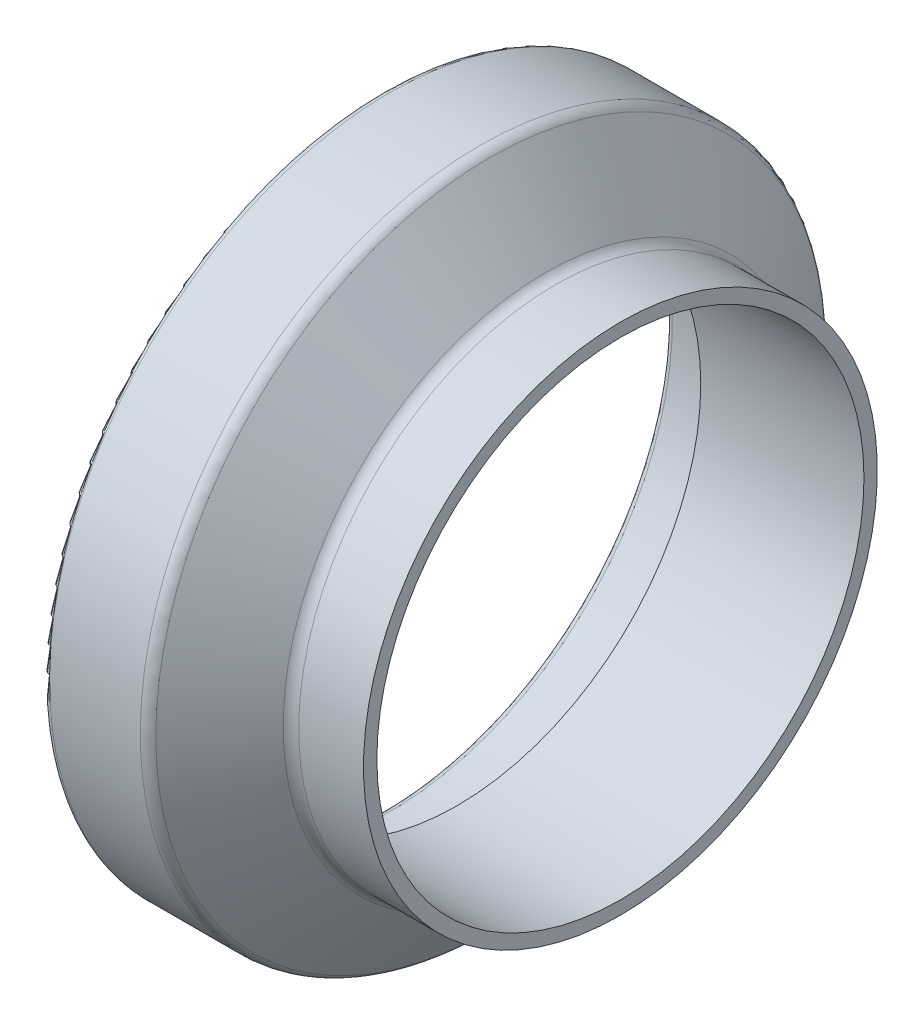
ISO-10303-21;
HEADER;
FILE_DESCRIPTION(('STEP AP214'),'2;1');
FILE_NAME('part.step','',(''),(''),'','','');
FILE_SCHEMA(('AUTOMOTIVE_DESIGN { 1 0 10303 214 1 1 1 1 }'));
ENDSEC;
DATA;
#1=APPLICATION_CONTEXT('core data for automotive mechanical design processes');
#2=APPLICATION_PROTOCOL_DEFINITION('international standard','automotive_design',2000,#1);
#3=PRODUCT_CONTEXT('',#1,'mechanical');
#4=PRODUCT('Part','Part','',(#3));
#5=PRODUCT_RELATED_PRODUCT_CATEGORY('part','',(#4));
#6=PRODUCT_DEFINITION_FORMATION('','',#4);
#7=PRODUCT_DEFINITION_CONTEXT('part definition',#1,'design');
#8=PRODUCT_DEFINITION('design','',#6,#7);
#9=PRODUCT_DEFINITION_SHAPE('','',#8);
#10=(LENGTH_UNIT() NAMED_UNIT(*) SI_UNIT(.MILLI.,.METRE.));
#11=(NAMED_UNIT(*) PLANE_ANGLE_UNIT() SI_UNIT($,.RADIAN.));
#12=(NAMED_UNIT(*) SI_UNIT($,.STERADIAN.) SOLID_ANGLE_UNIT());
#13=UNCERTAINTY_MEASURE_WITH_UNIT(LENGTH_MEASURE(1.E-05),#10,'distance_accuracy_value','');
#14=(GEOMETRIC_REPRESENTATION_CONTEXT(3) GLOBAL_UNCERTAINTY_ASSIGNED_CONTEXT((#13)) GLOBAL_UNIT_ASSIGNED_CONTEXT((#10,
#11,#12)) REPRESENTATION_CONTEXT('',''));
#15=CARTESIAN_POINT('',(0.,0.,0.));
#16=DIRECTION('',(0.,0.,1.));
#17=DIRECTION('',(1.,0.,0.));
#18=AXIS2_PLACEMENT_3D('',#15,#16,#17);
#19=CARTESIAN_POINT('',(-6.4271835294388,31.75,0.));
#20=DIRECTION('',(0.999999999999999,0.,0.));
#21=DIRECTION('',(0.,0.999999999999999,0.));
#22=AXIS2_PLACEMENT_3D('',#19,#20,#21);
#23=PLANE('',#22);
#24=CARTESIAN_POINT('',(-6.42718352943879,0.,0.));
#25=DIRECTION('',(0.999999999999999,0.,0.));
#26=DIRECTION('',(0.,0.999999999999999,0.));
#27=AXIS2_PLACEMENT_3D('',#24,#25,#26);
#28=CIRCLE('',#27,31.75);
#29=CARTESIAN_POINT('',(-6.4271835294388,31.75,0.));
#30=VERTEX_POINT('',#29);
#31=EDGE_CURVE('E81',#30,#30,#28,.T.);
#32=ORIENTED_EDGE('',*,*,#31,.T.);
#33=EDGE_LOOP('',(#32));
#34=FACE_BOUND('',#33,.T.);
#35=CARTESIAN_POINT('',(-6.42718352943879,0.,0.));
#36=DIRECTION('',(0.999999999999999,0.,0.));
#37=DIRECTION('',(0.,0.999999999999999,0.));
#38=AXIS2_PLACEMENT_3D('',#35,#36,#37);
#39=CIRCLE('',#38,30.099);
#40=CARTESIAN_POINT('',(-6.4271835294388,30.099,0.));
#41=VERTEX_POINT('',#40);
#42=EDGE_CURVE('E12',#41,#41,#39,.T.);
#43=ORIENTED_EDGE('',*,*,#42,.F.);
#44=EDGE_LOOP('',(#43));
#45=FACE_BOUND('',#44,.T.);
#46=ADVANCED_FACE('F38',(#34,#45),#23,.T.);
#47=CARTESIAN_POINT('',(0.,0.,0.));
#48=DIRECTION('',(0.999999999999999,0.,0.));
#49=DIRECTION('',(0.,0.999999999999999,0.));
#50=AXIS2_PLACEMENT_3D('',#47,#48,#49);
#51=CYLINDRICAL_SURFACE('',#50,30.099);
#52=CARTESIAN_POINT('',(-26.5947835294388,0.,0.));
#53=DIRECTION('',(0.999999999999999,0.,0.));
#54=DIRECTION('',(0.,0.999999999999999,0.));
#55=AXIS2_PLACEMENT_3D('',#52,#53,#54);
#56=CIRCLE('',#55,30.099);
#57=CARTESIAN_POINT('',(-26.5947835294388,30.099,0.));
#58=VERTEX_POINT('',#57);
#59=EDGE_CURVE('E44',#58,#58,#56,.T.);
#60=CARTESIAN_POINT('',(-6.4271835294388,30.099,0.));
#61=CARTESIAN_POINT('',(-6.63726269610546,30.099,0.));
#62=CARTESIAN_POINT('',(-6.84734186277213,30.099,0.));
#63=CARTESIAN_POINT('',(-7.26750019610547,30.099,0.));
#64=CARTESIAN_POINT('',(-7.47757936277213,30.099,0.));
#65=CARTESIAN_POINT('',(-7.89773769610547,30.099,0.));
#66=CARTESIAN_POINT('',(-8.10781686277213,30.099,0.));
#67=CARTESIAN_POINT('',(-8.52797519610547,30.099,0.));
#68=CARTESIAN_POINT('',(-8.73805436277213,30.099,0.));
#69=CARTESIAN_POINT('',(-9.15821269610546,30.099,0.));
#70=CARTESIAN_POINT('',(-9.36829186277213,30.099,0.));
#71=CARTESIAN_POINT('',(-9.78845019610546,30.099,0.));
#72=CARTESIAN_POINT('',(-9.99852936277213,30.099,0.));
#73=CARTESIAN_POINT('',(-10.4186876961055,30.099,0.));
#74=CARTESIAN_POINT('',(-10.6287668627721,30.099,0.));
#75=CARTESIAN_POINT('',(-11.0489251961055,30.099,0.));
#76=CARTESIAN_POINT('',(-11.2590043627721,30.099,0.));
#77=CARTESIAN_POINT('',(-11.6791626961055,30.099,0.));
#78=CARTESIAN_POINT('',(-11.8892418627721,30.099,0.));
#79=CARTESIAN_POINT('',(-12.3094001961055,30.099,0.));
#80=CARTESIAN_POINT('',(-12.5194793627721,30.099,0.));
#81=CARTESIAN_POINT('',(-12.9396376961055,30.099,0.));
#82=CARTESIAN_POINT('',(-13.1497168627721,30.099,0.));
#83=CARTESIAN_POINT('',(-13.5698751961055,30.099,0.));
#84=CARTESIAN_POINT('',(-13.7799543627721,30.099,0.));
#85=CARTESIAN_POINT('',(-14.2001126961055,30.099,0.));
#86=CARTESIAN_POINT('',(-14.4101918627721,30.099,0.));
#87=CARTESIAN_POINT('',(-14.8303501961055,30.099,0.));
#88=CARTESIAN_POINT('',(-15.0404293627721,30.099,0.));
#89=CARTESIAN_POINT('',(-15.4605876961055,30.099,0.));
#90=CARTESIAN_POINT('',(-15.6706668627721,30.099,0.));
#91=CARTESIAN_POINT('',(-16.0908251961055,30.099,0.));
#92=CARTESIAN_POINT('',(-16.3009043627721,30.099,0.));
#93=CARTESIAN_POINT('',(-16.7210626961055,30.099,0.));
#94=CARTESIAN_POINT('',(-16.9311418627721,30.099,0.));
#95=CARTESIAN_POINT('',(-17.3513001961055,30.099,0.));
#96=CARTESIAN_POINT('',(-17.5613793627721,30.099,0.));
#97=CARTESIAN_POINT('',(-17.9815376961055,30.099,0.));
#98=CARTESIAN_POINT('',(-18.1916168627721,30.099,0.));
#99=CARTESIAN_POINT('',(-18.6117751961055,30.099,0.));
#100=CARTESIAN_POINT('',(-18.8218543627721,30.099,0.));
#101=CARTESIAN_POINT('',(-19.2420126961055,30.099,0.));
#102=CARTESIAN_POINT('',(-19.4520918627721,30.099,0.));
#103=CARTESIAN_POINT('',(-19.8722501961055,30.099,0.));
#104=CARTESIAN_POINT('',(-20.0823293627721,30.099,0.));
#105=CARTESIAN_POINT('',(-20.5024876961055,30.099,0.));
#106=CARTESIAN_POINT('',(-20.7125668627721,30.099,0.));
#107=CARTESIAN_POINT('',(-21.1327251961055,30.099,0.));
#108=CARTESIAN_POINT('',(-21.3428043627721,30.099,0.));
#109=CARTESIAN_POINT('',(-21.7629626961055,30.099,0.));
#110=CARTESIAN_POINT('',(-21.9730418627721,30.099,0.));
#111=CARTESIAN_POINT('',(-22.3932001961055,30.099,0.));
#112=CARTESIAN_POINT('',(-22.6032793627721,30.099,0.));
#113=CARTESIAN_POINT('',(-23.0234376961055,30.099,0.));
#114=CARTESIAN_POINT('',(-23.2335168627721,30.099,0.));
#115=CARTESIAN_POINT('',(-23.6536751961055,30.099,0.));
#116=CARTESIAN_POINT('',(-23.8637543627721,30.099,0.));
#117=CARTESIAN_POINT('',(-24.2839126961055,30.099,0.));
#118=CARTESIAN_POINT('',(-24.4939918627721,30.099,0.));
#119=CARTESIAN_POINT('',(-24.9141501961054,30.099,0.));
#120=CARTESIAN_POINT('',(-25.1242293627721,30.099,0.));
#121=CARTESIAN_POINT('',(-25.5443876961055,30.099,0.));
#122=CARTESIAN_POINT('',(-25.7544668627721,30.099,0.));
#123=CARTESIAN_POINT('',(-26.1746251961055,30.099,0.));
#124=CARTESIAN_POINT('',(-26.3847043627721,30.099,0.));
#125=CARTESIAN_POINT('',(-26.5947835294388,30.099,0.));
#126=B_SPLINE_CURVE_WITH_KNOTS('',3,(#60,#61,#62,#63,#64,#65,#66,#67,#68,#69,#70,#71,#72,#73,
#74,#75,#76,#77,#78,#79,#80,#81,#82,#83,#84,#85,#86,#87,#88,#89,#90,#91,#92,#93,#94,#95,#96,#97,
#98,#99,#100,#101,#102,#103,#104,#105,#106,#107,#108,#109,#110,#111,#112,#113,#114,#115,#116,
#117,#118,#119,#120,#121,#122,#123,#124,#125),.UNSPECIFIED.,.F.,.F.,(4,2,2,2,2,2,2,2,2,2,2,2,2,
2,2,2,2,2,2,2,2,2,2,2,2,2,2,2,2,2,2,2,4),(0.,0.6302375,1.260475,1.8907125,2.52095,3.1511875,
3.781425,4.4116625,5.0419,5.6721375,6.302375,6.9326125,7.56285,8.19308749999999,8.823325,
9.45356249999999,10.0838,10.7140375,11.344275,11.9745125,12.60475,13.2349875,13.865225,
14.4954625,15.1257,15.7559375,16.386175,17.0164125,17.64665,18.2768875,18.907125,19.5373625,
20.1676),.UNSPECIFIED.);
#127=EDGE_CURVE('BSEAM99',#41,#58,#126,.T.);
#128=ORIENTED_EDGE('',*,*,#42,.T.);
#129=ORIENTED_EDGE('',*,*,#59,.F.);
#130=ORIENTED_EDGE('',*,*,#127,.T.);
#131=ORIENTED_EDGE('',*,*,#127,.F.);
#132=EDGE_LOOP('',(#128,#130,#129,#131));
#133=FACE_BOUND('',#132,.T.);
#134=ADVANCED_FACE('F99',(#133),#51,.F.);
#135=CARTESIAN_POINT('',(-26.5947835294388,30.099,0.));
#136=DIRECTION('',(-0.999999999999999,0.,0.));
#137=DIRECTION('',(0.,-0.999999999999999,0.));
#138=AXIS2_PLACEMENT_3D('',#135,#136,#137);
#139=PLANE('',#138);
#140=ORIENTED_EDGE('',*,*,#59,.T.);
#141=EDGE_LOOP('',(#140));
#142=FACE_BOUND('',#141,.T.);
#143=CARTESIAN_POINT('',(-26.5947835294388,0.,0.));
#144=DIRECTION('',(0.999999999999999,0.,0.));
#145=DIRECTION('',(0.,0.999999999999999,0.));
#146=AXIS2_PLACEMENT_3D('',#143,#144,#145);
#147=CIRCLE('',#146,34.1503);
#148=CARTESIAN_POINT('',(-26.5947835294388,34.1503,0.));
#149=VERTEX_POINT('',#148);
#150=EDGE_CURVE('E48',#149,#149,#147,.T.);
#151=ORIENTED_EDGE('',*,*,#150,.F.);
#152=EDGE_LOOP('',(#151));
#153=FACE_BOUND('',#152,.T.);
#154=ADVANCED_FACE('F103',(#142,#153),#139,.T.);
#155=CARTESIAN_POINT('',(-27.4075835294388,0.,0.));
#156=DIRECTION('',(0.999999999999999,0.,0.));
#157=DIRECTION('',(0.,0.999999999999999,0.));
#158=AXIS2_PLACEMENT_3D('',#155,#156,#157);
#159=TOROIDAL_SURFACE('',#158,34.1503,0.812799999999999);
#160=ORIENTED_EDGE('',*,*,#150,.T.);
#161=EDGE_LOOP('',(#160));
#162=FACE_BOUND('',#161,.T.);
#163=CARTESIAN_POINT('',(-27.4075835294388,0.,0.));
#164=DIRECTION('',(0.999999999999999,0.,0.));
#165=DIRECTION('',(0.,0.999999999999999,0.));
#166=AXIS2_PLACEMENT_3D('',#163,#164,#165);
#167=CIRCLE('',#166,34.9631);
#168=CARTESIAN_POINT('',(-27.4075835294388,34.9631,0.));
#169=VERTEX_POINT('',#168);
#170=EDGE_CURVE('E52',#169,#169,#167,.T.);
#171=ORIENTED_EDGE('',*,*,#170,.F.);
#172=EDGE_LOOP('',(#171));
#173=FACE_BOUND('',#172,.T.);
#174=ADVANCED_FACE('F107',(#162,#173),#159,.F.);
#175=CARTESIAN_POINT('',(0.,0.,0.));
#176=DIRECTION('',(0.999999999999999,0.,0.));
#177=DIRECTION('',(0.,0.999999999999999,0.));
#178=AXIS2_PLACEMENT_3D('',#175,#176,#177);
#179=CYLINDRICAL_SURFACE('',#178,34.9631);
#180=CARTESIAN_POINT('',(-34.9767835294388,0.,0.));
#181=DIRECTION('',(0.999999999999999,0.,0.));
#182=DIRECTION('',(0.,0.999999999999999,0.));
#183=AXIS2_PLACEMENT_3D('',#180,#181,#182);
#184=CIRCLE('',#183,34.9631);
#185=CARTESIAN_POINT('',(-34.9767835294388,34.9631,0.));
#186=VERTEX_POINT('',#185);
#187=EDGE_CURVE('E57',#186,#186,#184,.T.);
#188=CARTESIAN_POINT('',(-27.4075835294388,34.9631,0.));
#189=CARTESIAN_POINT('',(-27.4864293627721,34.9631,0.));
#190=CARTESIAN_POINT('',(-27.5652751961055,34.9631,0.));
#191=CARTESIAN_POINT('',(-27.7229668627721,34.9631,0.));
#192=CARTESIAN_POINT('',(-27.8018126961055,34.9631,0.));
#193=CARTESIAN_POINT('',(-27.9595043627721,34.9631,0.));
#194=CARTESIAN_POINT('',(-28.0383501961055,34.9631,0.));
#195=CARTESIAN_POINT('',(-28.1960418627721,34.9631,0.));
#196=CARTESIAN_POINT('',(-28.2748876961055,34.9631,0.));
#197=CARTESIAN_POINT('',(-28.4325793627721,34.9631,0.));
#198=CARTESIAN_POINT('',(-28.5114251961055,34.9631,0.));
#199=CARTESIAN_POINT('',(-28.6691168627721,34.9631,0.));
#200=CARTESIAN_POINT('',(-28.7479626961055,34.9631,0.));
#201=CARTESIAN_POINT('',(-28.9056543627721,34.9631,0.));
#202=CARTESIAN_POINT('',(-28.9845001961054,34.9631,0.));
#203=CARTESIAN_POINT('',(-29.1421918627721,34.9631,0.));
#204=CARTESIAN_POINT('',(-29.2210376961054,34.9631,0.));
#205=CARTESIAN_POINT('',(-29.3787293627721,34.9631,0.));
#206=CARTESIAN_POINT('',(-29.4575751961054,34.9631,0.));
#207=CARTESIAN_POINT('',(-29.6152668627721,34.9631,0.));
#208=CARTESIAN_POINT('',(-29.6941126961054,34.9631,0.));
#209=CARTESIAN_POINT('',(-29.8518043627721,34.9631,0.));
#210=CARTESIAN_POINT('',(-29.9306501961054,34.9631,0.));
#211=CARTESIAN_POINT('',(-30.0883418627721,34.9631,0.));
#212=CARTESIAN_POINT('',(-30.1671876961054,34.9631,0.));
#213=CARTESIAN_POINT('',(-30.3248793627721,34.9631,0.));
#214=CARTESIAN_POINT('',(-30.4037251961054,34.9631,0.));
#215=CARTESIAN_POINT('',(-30.5614168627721,34.9631,0.));
#216=CARTESIAN_POINT('',(-30.6402626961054,34.9631,0.));
#217=CARTESIAN_POINT('',(-30.7979543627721,34.9631,0.));
#218=CARTESIAN_POINT('',(-30.8768001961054,34.9631,0.));
#219=CARTESIAN_POINT('',(-31.0344918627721,34.9631,0.));
#220=CARTESIAN_POINT('',(-31.1133376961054,34.9631,0.));
#221=CARTESIAN_POINT('',(-31.2710293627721,34.9631,0.));
#222=CARTESIAN_POINT('',(-31.3498751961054,34.9631,0.));
#223=CARTESIAN_POINT('',(-31.5075668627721,34.9631,0.));
#224=CARTESIAN_POINT('',(-31.5864126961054,34.9631,0.));
#225=CARTESIAN_POINT('',(-31.7441043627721,34.9631,0.));
#226=CARTESIAN_POINT('',(-31.8229501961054,34.9631,0.));
#227=CARTESIAN_POINT('',(-31.9806418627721,34.9631,0.));
#228=CARTESIAN_POINT('',(-32.0594876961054,34.9631,0.));
#229=CARTESIAN_POINT('',(-32.2171793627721,34.9631,0.));
#230=CARTESIAN_POINT('',(-32.2960251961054,34.9631,0.));
#231=CARTESIAN_POINT('',(-32.4537168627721,34.9631,0.));
#232=CARTESIAN_POINT('',(-32.5325626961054,34.9631,0.));
#233=CARTESIAN_POINT('',(-32.6902543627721,34.9631,0.));
#234=CARTESIAN_POINT('',(-32.7691001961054,34.9631,0.));
#235=CARTESIAN_POINT('',(-32.9267918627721,34.9631,0.));
#236=CARTESIAN_POINT('',(-33.0056376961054,34.9631,0.));
#237=CARTESIAN_POINT('',(-33.1633293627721,34.9631,0.));
#238=CARTESIAN_POINT('',(-33.2421751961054,34.9631,0.));
#239=CARTESIAN_POINT('',(-33.3998668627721,34.9631,0.));
#240=CARTESIAN_POINT('',(-33.4787126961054,34.9631,0.));
#241=CARTESIAN_POINT('',(-33.6364043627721,34.9631,0.));
#242=CARTESIAN_POINT('',(-33.7152501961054,34.9631,0.));
#243=CARTESIAN_POINT('',(-33.8729418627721,34.9631,0.));
#244=CARTESIAN_POINT('',(-33.9517876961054,34.9631,0.));
#245=CARTESIAN_POINT('',(-34.1094793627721,34.9631,0.));
#246=CARTESIAN_POINT('',(-34.1883251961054,34.9631,0.));
#247=CARTESIAN_POINT('',(-34.3460168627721,34.9631,0.));
#248=CARTESIAN_POINT('',(-34.4248626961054,34.9631,0.));
#249=CARTESIAN_POINT('',(-34.5825543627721,34.9631,0.));
#250=CARTESIAN_POINT('',(-34.6614001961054,34.9631,0.));
#251=CARTESIAN_POINT('',(-34.8190918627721,34.9631,0.));
#252=CARTESIAN_POINT('',(-34.8979376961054,34.9631,0.));
#253=CARTESIAN_POINT('',(-34.9767835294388,34.9631,0.));
#254=B_SPLINE_CURVE_WITH_KNOTS('',3,(#188,#189,#190,#191,#192,#193,#194,#195,#196,#197,#198,
#199,#200,#201,#202,#203,#204,#205,#206,#207,#208,#209,#210,#211,#212,#213,#214,#215,#216,#217,
#218,#219,#220,#221,#222,#223,#224,#225,#226,#227,#228,#229,#230,#231,#232,#233,#234,#235,#236,
#237,#238,#239,#240,#241,#242,#243,#244,#245,#246,#247,#248,#249,#250,#251,#252,#253),
.UNSPECIFIED.,.F.,.F.,(4,2,2,2,2,2,2,2,2,2,2,2,2,2,2,2,2,2,2,2,2,2,2,2,2,2,2,2,2,2,2,2,4),(0.,
0.236537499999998,0.473075,0.709612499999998,0.946149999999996,1.1826875,1.41922499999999,
1.65576249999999,1.89229999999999,2.12883749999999,2.36537499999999,2.60191249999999,
2.83844999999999,3.07498749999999,3.31152499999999,3.54806249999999,3.78459999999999,
4.02113749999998,4.25767499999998,4.49421249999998,4.73074999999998,4.96728749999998,
5.20382499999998,5.44036249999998,5.67689999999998,5.91343749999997,6.14997499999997,
6.38651249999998,6.62304999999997,6.85958749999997,7.09612499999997,7.33266249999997,
7.56919999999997),.UNSPECIFIED.);
#255=EDGE_CURVE('BSEAM113',#169,#186,#254,.T.);
#256=ORIENTED_EDGE('',*,*,#170,.T.);
#257=ORIENTED_EDGE('',*,*,#187,.F.);
#258=ORIENTED_EDGE('',*,*,#255,.T.);
#259=ORIENTED_EDGE('',*,*,#255,.F.);
#260=EDGE_LOOP('',(#256,#258,#257,#259));
#261=FACE_BOUND('',#260,.T.);
#262=ADVANCED_FACE('F113',(#261),#179,.F.);
#263=CARTESIAN_POINT('',(-34.9767835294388,0.,0.));
#264=DIRECTION('',(0.999999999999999,0.,0.));
#265=DIRECTION('',(0.,0.999999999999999,0.));
#266=AXIS2_PLACEMENT_3D('',#263,#264,#265);
#267=TOROIDAL_SURFACE('',#266,35.7759,0.812800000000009);
#268=ORIENTED_EDGE('',*,*,#187,.T.);
#269=EDGE_LOOP('',(#268));
#270=FACE_BOUND('',#269,.T.);
#271=CARTESIAN_POINT('',(-35.7895835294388,0.,0.));
#272=DIRECTION('',(0.999999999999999,0.,0.));
#273=DIRECTION('',(0.,0.999999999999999,0.));
#274=AXIS2_PLACEMENT_3D('',#271,#272,#273);
#275=CIRCLE('',#274,35.7759);
#276=CARTESIAN_POINT('',(-35.7895835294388,35.7759,0.));
#277=VERTEX_POINT('',#276);
#278=EDGE_CURVE('E60',#277,#277,#275,.T.);
#279=ORIENTED_EDGE('',*,*,#278,.F.);
#280=EDGE_LOOP('',(#279));
#281=FACE_BOUND('',#280,.T.);
#282=ADVANCED_FACE('F117',(#270,#281),#267,.T.);
#283=CARTESIAN_POINT('',(-35.7895835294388,35.7759,0.));
#284=DIRECTION('',(-0.999999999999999,0.,0.));
#285=DIRECTION('',(0.,-0.999999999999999,0.));
#286=AXIS2_PLACEMENT_3D('',#283,#284,#285);
#287=PLANE('',#286);
#288=ORIENTED_EDGE('',*,*,#278,.T.);
#289=EDGE_LOOP('',(#288));
#290=FACE_BOUND('',#289,.T.);
#291=CARTESIAN_POINT('',(-35.7895835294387,0.,0.));
#292=DIRECTION('',(0.999999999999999,0.,0.));
#293=DIRECTION('',(0.,0.999999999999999,0.));
#294=AXIS2_PLACEMENT_3D('',#291,#292,#293);
#295=CIRCLE('',#294,41.1861);
#296=CARTESIAN_POINT('',(-35.7895835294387,41.1860999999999,0.));
#297=VERTEX_POINT('',#296);
#298=EDGE_CURVE('E63',#297,#297,#295,.T.);
#299=ORIENTED_EDGE('',*,*,#298,.F.);
#300=EDGE_LOOP('',(#299));
#301=FACE_BOUND('',#300,.T.);
#302=ADVANCED_FACE('F121',(#290,#301),#287,.T.);
#303=CARTESIAN_POINT('',(-34.9767835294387,0.,0.));
#304=DIRECTION('',(0.999999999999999,0.,0.));
#305=DIRECTION('',(0.,0.999999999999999,0.));
#306=AXIS2_PLACEMENT_3D('',#303,#304,#305);
#307=TOROIDAL_SURFACE('',#306,41.1861,0.812799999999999);
#308=ORIENTED_EDGE('',*,*,#298,.T.);
#309=EDGE_LOOP('',(#308));
#310=FACE_BOUND('',#309,.T.);
#311=CARTESIAN_POINT('',(-34.9767835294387,0.,0.));
#312=DIRECTION('',(0.999999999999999,0.,0.));
#313=DIRECTION('',(0.,0.999999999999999,0.));
#314=AXIS2_PLACEMENT_3D('',#311,#312,#313);
#315=CIRCLE('',#314,41.9989);
#316=CARTESIAN_POINT('',(-34.9767835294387,41.9988999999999,0.));
#317=VERTEX_POINT('',#316);
#318=EDGE_CURVE('E66',#317,#317,#315,.T.);
#319=ORIENTED_EDGE('',*,*,#318,.F.);
#320=EDGE_LOOP('',(#319));
#321=FACE_BOUND('',#320,.T.);
#322=ADVANCED_FACE('F125',(#310,#321),#307,.T.);
#323=CARTESIAN_POINT('',(0.,0.,0.));
#324=DIRECTION('',(0.999999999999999,0.,0.));
#325=DIRECTION('',(0.,0.999999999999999,0.));
#326=AXIS2_PLACEMENT_3D('',#323,#324,#325);
#327=CYLINDRICAL_SURFACE('',#326,41.9989);
#328=CARTESIAN_POINT('',(-23.7604138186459,0.,0.));
#329=DIRECTION('',(0.999999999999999,0.,0.));
#330=DIRECTION('',(0.,0.999999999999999,0.));
#331=AXIS2_PLACEMENT_3D('',#328,#329,#330);
#332=CIRCLE('',#331,41.9989);
#333=CARTESIAN_POINT('',(-23.7604138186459,41.9988999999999,0.));
#334=VERTEX_POINT('',#333);
#335=EDGE_CURVE('E69',#334,#334,#332,.T.);
#336=CARTESIAN_POINT('',(-34.9767835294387,41.9988999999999,0.));
#337=CARTESIAN_POINT('',(-34.8599463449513,41.9988999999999,0.));
#338=CARTESIAN_POINT('',(-34.7431091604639,41.9988999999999,0.));
#339=CARTESIAN_POINT('',(-34.509434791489,41.9988999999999,0.));
#340=CARTESIAN_POINT('',(-34.3925976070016,41.9988999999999,0.));
#341=CARTESIAN_POINT('',(-34.1589232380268,41.9988999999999,0.));
#342=CARTESIAN_POINT('',(-34.0420860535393,41.9988999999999,0.));
#343=CARTESIAN_POINT('',(-33.8084116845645,41.9988999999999,0.));
#344=CARTESIAN_POINT('',(-33.6915745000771,41.9988999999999,0.));
#345=CARTESIAN_POINT('',(-33.4579001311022,41.9988999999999,0.));
#346=CARTESIAN_POINT('',(-33.3410629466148,41.9988999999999,0.));
#347=CARTESIAN_POINT('',(-33.1073885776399,41.9988999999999,0.));
#348=CARTESIAN_POINT('',(-32.9905513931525,41.9988999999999,0.));
#349=CARTESIAN_POINT('',(-32.7568770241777,41.9988999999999,0.));
#350=CARTESIAN_POINT('',(-32.6400398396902,41.9988999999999,0.));
#351=CARTESIAN_POINT('',(-32.4063654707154,41.9988999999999,0.));
#352=CARTESIAN_POINT('',(-32.289528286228,41.9988999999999,0.));
#353=CARTESIAN_POINT('',(-32.0558539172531,41.9988999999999,0.));
#354=CARTESIAN_POINT('',(-31.9390167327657,41.9988999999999,0.));
#355=CARTESIAN_POINT('',(-31.7053423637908,41.9988999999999,0.));
#356=CARTESIAN_POINT('',(-31.5885051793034,41.9988999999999,0.));
#357=CARTESIAN_POINT('',(-31.3548308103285,41.9988999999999,0.));
#358=CARTESIAN_POINT('',(-31.2379936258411,41.9988999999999,0.));
#359=CARTESIAN_POINT('',(-31.0043192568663,41.9988999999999,0.));
#360=CARTESIAN_POINT('',(-30.8874820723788,41.9988999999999,0.));
#361=CARTESIAN_POINT('',(-30.653807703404,41.9988999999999,0.));
#362=CARTESIAN_POINT('',(-30.5369705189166,41.9988999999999,0.));
#363=CARTESIAN_POINT('',(-30.3032961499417,41.9988999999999,0.));
#364=CARTESIAN_POINT('',(-30.1864589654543,41.9988999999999,0.));
#365=CARTESIAN_POINT('',(-29.9527845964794,41.9988999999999,0.));
#366=CARTESIAN_POINT('',(-29.835947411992,41.9988999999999,0.));
#367=CARTESIAN_POINT('',(-29.6022730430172,41.9988999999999,0.));
#368=CARTESIAN_POINT('',(-29.4854358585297,41.9988999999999,0.));
#369=CARTESIAN_POINT('',(-29.2517614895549,41.9988999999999,0.));
#370=CARTESIAN_POINT('',(-29.1349243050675,41.9988999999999,0.));
#371=CARTESIAN_POINT('',(-28.9012499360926,41.9988999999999,0.));
#372=CARTESIAN_POINT('',(-28.7844127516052,41.9988999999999,0.));
#373=CARTESIAN_POINT('',(-28.5507383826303,41.9988999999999,0.));
#374=CARTESIAN_POINT('',(-28.4339011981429,41.9988999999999,0.));
#375=CARTESIAN_POINT('',(-28.2002268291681,41.9988999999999,0.));
#376=CARTESIAN_POINT('',(-28.0833896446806,41.9988999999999,0.));
#377=CARTESIAN_POINT('',(-27.8497152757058,41.9988999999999,0.));
#378=CARTESIAN_POINT('',(-27.7328780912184,41.9988999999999,0.));
#379=CARTESIAN_POINT('',(-27.4992037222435,41.9988999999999,0.));
#380=CARTESIAN_POINT('',(-27.3823665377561,41.9988999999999,0.));
#381=CARTESIAN_POINT('',(-27.1486921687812,41.9988999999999,0.));
#382=CARTESIAN_POINT('',(-27.0318549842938,41.9988999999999,0.));
#383=CARTESIAN_POINT('',(-26.798180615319,41.9988999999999,0.));
#384=CARTESIAN_POINT('',(-26.6813434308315,41.9988999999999,0.));
#385=CARTESIAN_POINT('',(-26.4476690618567,41.9988999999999,0.));
#386=CARTESIAN_POINT('',(-26.3308318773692,41.9988999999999,0.));
#387=CARTESIAN_POINT('',(-26.0971575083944,41.9988999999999,0.));
#388=CARTESIAN_POINT('',(-25.980320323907,41.9988999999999,0.));
#389=CARTESIAN_POINT('',(-25.7466459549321,41.9988999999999,0.));
#390=CARTESIAN_POINT('',(-25.6298087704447,41.9988999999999,0.));
#391=CARTESIAN_POINT('',(-25.3961344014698,41.9988999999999,0.));
#392=CARTESIAN_POINT('',(-25.2792972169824,41.9988999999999,0.));
#393=CARTESIAN_POINT('',(-25.0456228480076,41.9988999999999,0.));
#394=CARTESIAN_POINT('',(-24.9287856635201,41.9988999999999,0.));
#395=CARTESIAN_POINT('',(-24.6951112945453,41.9988999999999,0.));
#396=CARTESIAN_POINT('',(-24.5782741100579,41.9988999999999,0.));
#397=CARTESIAN_POINT('',(-24.344599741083,41.9988999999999,0.));
#398=CARTESIAN_POINT('',(-24.2277625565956,41.9988999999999,0.));
#399=CARTESIAN_POINT('',(-23.9940881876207,41.9988999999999,0.));
#400=CARTESIAN_POINT('',(-23.8772510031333,41.9988999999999,0.));
#401=CARTESIAN_POINT('',(-23.7604138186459,41.9988999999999,0.));
#402=B_SPLINE_CURVE_WITH_KNOTS('',3,(#336,#337,#338,#339,#340,#341,#342,#343,#344,#345,#346,
#347,#348,#349,#350,#351,#352,#353,#354,#355,#356,#357,#358,#359,#360,#361,#362,#363,#364,#365,
#366,#367,#368,#369,#370,#371,#372,#373,#374,#375,#376,#377,#378,#379,#380,#381,#382,#383,#384,
#385,#386,#387,#388,#389,#390,#391,#392,#393,#394,#395,#396,#397,#398,#399,#400,#401),
.UNSPECIFIED.,.F.,.F.,(4,2,2,2,2,2,2,2,2,2,2,2,2,2,2,2,2,2,2,2,2,2,2,2,2,2,2,2,2,2,2,2,4),(0.,
0.350511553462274,0.701023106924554,1.05153466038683,1.40204621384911,1.75255776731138,
2.10306932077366,2.45358087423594,2.80409242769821,3.15460398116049,3.50511553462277,
3.85562708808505,4.20613864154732,4.5566501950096,4.90716174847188,5.25767330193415,
5.60818485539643,5.95869640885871,6.30920796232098,6.65971951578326,7.01023106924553,
7.36074262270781,7.71125417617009,8.06176572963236,8.41227728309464,8.76278883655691,
9.11330039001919,9.46381194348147,9.81432349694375,10.164835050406,10.5153466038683,
10.8658581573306,11.2163697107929),.UNSPECIFIED.);
#403=EDGE_CURVE('BSEAM129',#317,#334,#402,.T.);
#404=ORIENTED_EDGE('',*,*,#318,.T.);
#405=ORIENTED_EDGE('',*,*,#335,.F.);
#406=ORIENTED_EDGE('',*,*,#403,.T.);
#407=ORIENTED_EDGE('',*,*,#403,.F.);
#408=EDGE_LOOP('',(#404,#406,#405,#407));
#409=FACE_BOUND('',#408,.T.);
#410=ADVANCED_FACE('F129',(#409),#327,.T.);
#411=CARTESIAN_POINT('',(-23.7604138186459,0.,0.));
#412=DIRECTION('',(0.999999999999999,0.,0.));
#413=DIRECTION('',(0.,0.999999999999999,0.));
#414=AXIS2_PLACEMENT_3D('',#411,#412,#413);
#415=TOROIDAL_SURFACE('',#414,40.3987,1.60019999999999);
#416=ORIENTED_EDGE('',*,*,#335,.T.);
#417=EDGE_LOOP('',(#416));
#418=FACE_BOUND('',#417,.T.);
#419=CARTESIAN_POINT('',(-22.4824372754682,0.,0.));
#420=DIRECTION('',(0.999999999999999,0.,0.));
#421=DIRECTION('',(0.,0.999999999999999,0.));
#422=AXIS2_PLACEMENT_3D('',#419,#420,#421);
#423=CIRCLE('',#422,41.3617244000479);
#424=CARTESIAN_POINT('',(-22.4824372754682,-41.3617244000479,0.));
#425=VERTEX_POINT('',#424);
#426=EDGE_CURVE('E72',#425,#425,#423,.T.);
#427=ORIENTED_EDGE('',*,*,#426,.F.);
#428=EDGE_LOOP('',(#427));
#429=FACE_BOUND('',#428,.T.);
#430=ADVANCED_FACE('F133',(#418,#429),#415,.T.);
#431=CARTESIAN_POINT('',(-15.7196296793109,0.,0.));
#432=DIRECTION('',(-0.999999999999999,0.,0.));
#433=DIRECTION('',(0.,-0.999999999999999,0.));
#434=AXIS2_PLACEMENT_3D('',#431,#432,#433);
#435=CONICAL_SURFACE('',#434,32.3871755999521,0.925024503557);
#436=CARTESIAN_POINT('',(-15.7196296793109,0.,0.));
#437=DIRECTION('',(0.999999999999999,0.,0.));
#438=DIRECTION('',(0.,0.999999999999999,0.));
#439=AXIS2_PLACEMENT_3D('',#436,#437,#438);
#440=CIRCLE('',#439,32.3871755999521);
#441=CARTESIAN_POINT('',(-15.7196296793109,-32.3871755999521,0.));
#442=VERTEX_POINT('',#441);
#443=EDGE_CURVE('E75',#442,#442,#440,.T.);
#444=CARTESIAN_POINT('',(-22.4824372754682,-41.3617244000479,0.));
#445=CARTESIAN_POINT('',(-22.4119913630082,-41.2682395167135,0.));
#446=CARTESIAN_POINT('',(-22.3415454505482,-41.1747546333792,0.));
#447=CARTESIAN_POINT('',(-22.2006536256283,-40.9877848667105,0.));
#448=CARTESIAN_POINT('',(-22.1302077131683,-40.8942999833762,0.));
#449=CARTESIAN_POINT('',(-21.9893158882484,-40.7073302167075,0.));
#450=CARTESIAN_POINT('',(-21.9188699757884,-40.6138453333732,0.));
#451=CARTESIAN_POINT('',(-21.7779781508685,-40.4268755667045,0.));
#452=CARTESIAN_POINT('',(-21.7075322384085,-40.3333906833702,0.));
#453=CARTESIAN_POINT('',(-21.5666404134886,-40.1464209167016,0.));
#454=CARTESIAN_POINT('',(-21.4961945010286,-40.0529360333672,0.));
#455=CARTESIAN_POINT('',(-21.3553026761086,-39.8659662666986,0.));
#456=CARTESIAN_POINT('',(-21.2848567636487,-39.7724813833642,0.));
#457=CARTESIAN_POINT('',(-21.1439649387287,-39.5855116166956,0.));
#458=CARTESIAN_POINT('',(-21.0735190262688,-39.4920267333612,0.));
#459=CARTESIAN_POINT('',(-20.9326272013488,-39.3050569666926,0.));
#460=CARTESIAN_POINT('',(-20.8621812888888,-39.2115720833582,0.));
#461=CARTESIAN_POINT('',(-20.7212894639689,-39.0246023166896,0.));
#462=CARTESIAN_POINT('',(-20.6508435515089,-38.9311174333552,0.));
#463=CARTESIAN_POINT('',(-20.509951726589,-38.7441476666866,0.));
#464=CARTESIAN_POINT('',(-20.439505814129,-38.6506627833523,0.));
#465=CARTESIAN_POINT('',(-20.2986139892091,-38.4636930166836,0.));
#466=CARTESIAN_POINT('',(-20.2281680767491,-38.3702081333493,0.));
#467=CARTESIAN_POINT('',(-20.0872762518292,-38.1832383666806,0.));
#468=CARTESIAN_POINT('',(-20.0168303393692,-38.0897534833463,0.));
#469=CARTESIAN_POINT('',(-19.8759385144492,-37.9027837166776,0.));
#470=CARTESIAN_POINT('',(-19.8054926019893,-37.8092988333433,0.));
#471=CARTESIAN_POINT('',(-19.6646007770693,-37.6223290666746,0.));
#472=CARTESIAN_POINT('',(-19.5941548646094,-37.5288441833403,0.));
#473=CARTESIAN_POINT('',(-19.4532630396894,-37.3418744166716,0.));
#474=CARTESIAN_POINT('',(-19.3828171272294,-37.2483895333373,0.));
#475=CARTESIAN_POINT('',(-19.2419253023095,-37.0614197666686,0.));
#476=CARTESIAN_POINT('',(-19.1714793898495,-36.9679348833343,0.));
#477=CARTESIAN_POINT('',(-19.0305875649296,-36.7809651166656,0.));
#478=CARTESIAN_POINT('',(-18.9601416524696,-36.6874802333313,0.));
#479=CARTESIAN_POINT('',(-18.8192498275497,-36.5005104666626,0.));
#480=CARTESIAN_POINT('',(-18.7488039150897,-36.4070255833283,0.));
#481=CARTESIAN_POINT('',(-18.6079120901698,-36.2200558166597,0.));
#482=CARTESIAN_POINT('',(-18.5374661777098,-36.1265709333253,0.));
#483=CARTESIAN_POINT('',(-18.3965743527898,-35.9396011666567,0.));
#484=CARTESIAN_POINT('',(-18.3261284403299,-35.8461162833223,0.));
#485=CARTESIAN_POINT('',(-18.1852366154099,-35.6591465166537,0.));
#486=CARTESIAN_POINT('',(-18.11479070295,-35.5656616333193,0.));
#487=CARTESIAN_POINT('',(-17.97389887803,-35.3786918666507,0.));
#488=CARTESIAN_POINT('',(-17.90345296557,-35.2852069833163,0.));
#489=CARTESIAN_POINT('',(-17.7625611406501,-35.0982372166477,0.));
#490=CARTESIAN_POINT('',(-17.6921152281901,-35.0047523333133,0.));
#491=CARTESIAN_POINT('',(-17.5512234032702,-34.8177825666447,0.));
#492=CARTESIAN_POINT('',(-17.4807774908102,-34.7242976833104,0.));
#493=CARTESIAN_POINT('',(-17.3398856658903,-34.5373279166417,0.));
#494=CARTESIAN_POINT('',(-17.2694397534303,-34.4438430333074,0.));
#495=CARTESIAN_POINT('',(-17.1285479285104,-34.2568732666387,0.));
#496=CARTESIAN_POINT('',(-17.0581020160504,-34.1633883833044,0.));
#497=CARTESIAN_POINT('',(-16.9172101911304,-33.9764186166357,0.));
#498=CARTESIAN_POINT('',(-16.8467642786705,-33.8829337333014,0.));
#499=CARTESIAN_POINT('',(-16.7058724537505,-33.6959639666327,0.));
#500=CARTESIAN_POINT('',(-16.6354265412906,-33.6024790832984,0.));
#501=CARTESIAN_POINT('',(-16.4945347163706,-33.4155093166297,0.));
#502=CARTESIAN_POINT('',(-16.4240888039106,-33.3220244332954,0.));
#503=CARTESIAN_POINT('',(-16.2831969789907,-33.1350546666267,0.));
#504=CARTESIAN_POINT('',(-16.2127510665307,-33.0415697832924,0.));
#505=CARTESIAN_POINT('',(-16.0718592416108,-32.8546000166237,0.));
#506=CARTESIAN_POINT('',(-16.0014133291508,-32.7611151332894,0.));
#507=CARTESIAN_POINT('',(-15.8605215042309,-32.5741453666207,0.));
#508=CARTESIAN_POINT('',(-15.7900755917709,-32.4806604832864,0.));
#509=CARTESIAN_POINT('',(-15.7196296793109,-32.3871755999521,0.));
#510=B_SPLINE_CURVE_WITH_KNOTS('',3,(#444,#445,#446,#447,#448,#449,#450,#451,#452,#453,#454,
#455,#456,#457,#458,#459,#460,#461,#462,#463,#464,#465,#466,#467,#468,#469,#470,#471,#472,#473,
#474,#475,#476,#477,#478,#479,#480,#481,#482,#483,#484,#485,#486,#487,#488,#489,#490,#491,#492,
#493,#494,#495,#496,#497,#498,#499,#500,#501,#502,#503,#504,#505,#506,#507,#508,#509),
.UNSPECIFIED.,.F.,.F.,(4,2,2,2,2,2,2,2,2,2,2,2,2,2,2,2,2,2,2,2,2,2,2,2,2,2,2,2,2,2,2,2,4),(0.,
0.351167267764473,0.702334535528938,1.05350180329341,1.40466907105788,1.75583633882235,
2.10700360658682,2.45817087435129,2.80933814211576,3.16050540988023,3.5116726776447,
3.86283994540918,4.21400721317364,4.56517448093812,4.91634174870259,5.26750901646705,
5.61867628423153,5.969843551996,6.32101081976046,6.67217808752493,7.0233453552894,
7.37451262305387,7.72567989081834,8.07684715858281,8.42801442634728,8.77918169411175,
9.13034896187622,9.48151622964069,9.83268349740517,10.1838507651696,10.5350180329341,
10.8861853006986,11.237352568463),.UNSPECIFIED.);
#511=EDGE_CURVE('BSEAM95',#425,#442,#510,.T.);
#512=ORIENTED_EDGE('',*,*,#426,.T.);
#513=ORIENTED_EDGE('',*,*,#443,.F.);
#514=ORIENTED_EDGE('',*,*,#511,.T.);
#515=ORIENTED_EDGE('',*,*,#511,.F.);
#516=EDGE_LOOP('',(#512,#514,#513,#515));
#517=FACE_BOUND('',#516,.T.);
#518=ADVANCED_FACE('F95',(#517),#435,.T.);
#519=CARTESIAN_POINT('',(-14.4416531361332,0.,0.));
#520=DIRECTION('',(0.999999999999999,0.,0.));
#521=DIRECTION('',(0.,0.999999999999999,0.));
#522=AXIS2_PLACEMENT_3D('',#519,#520,#521);
#523=TOROIDAL_SURFACE('',#522,33.3502,1.6002);
#524=ORIENTED_EDGE('',*,*,#443,.T.);
#525=EDGE_LOOP('',(#524));
#526=FACE_BOUND('',#525,.T.);
#527=CARTESIAN_POINT('',(-14.4416531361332,0.,0.));
#528=DIRECTION('',(0.999999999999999,0.,0.));
#529=DIRECTION('',(0.,0.999999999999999,0.));
#530=AXIS2_PLACEMENT_3D('',#527,#528,#529);
#531=CIRCLE('',#530,31.75);
#532=CARTESIAN_POINT('',(-14.4416531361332,31.75,0.));
#533=VERTEX_POINT('',#532);
#534=EDGE_CURVE('E78',#533,#533,#531,.T.);
#535=ORIENTED_EDGE('',*,*,#534,.F.);
#536=EDGE_LOOP('',(#535));
#537=FACE_BOUND('',#536,.T.);
#538=ADVANCED_FACE('F89',(#526,#537),#523,.F.);
#539=CARTESIAN_POINT('',(0.,0.,0.));
#540=DIRECTION('',(0.999999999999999,0.,0.));
#541=DIRECTION('',(0.,0.999999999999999,0.));
#542=AXIS2_PLACEMENT_3D('',#539,#540,#541);
#543=CYLINDRICAL_SURFACE('',#542,31.75);
#544=CARTESIAN_POINT('',(-14.4416531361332,31.75,0.));
#545=CARTESIAN_POINT('',(-14.3581690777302,31.75,0.));
#546=CARTESIAN_POINT('',(-14.2746850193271,31.75,0.));
#547=CARTESIAN_POINT('',(-14.107716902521,31.75,0.));
#548=CARTESIAN_POINT('',(-14.0242328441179,31.75,0.));
#549=CARTESIAN_POINT('',(-13.8572647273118,31.75,0.));
#550=CARTESIAN_POINT('',(-13.7737806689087,31.75,0.));
#551=CARTESIAN_POINT('',(-13.6068125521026,31.75,0.));
#552=CARTESIAN_POINT('',(-13.5233284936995,31.75,0.));
#553=CARTESIAN_POINT('',(-13.3563603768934,31.75,0.));
#554=CARTESIAN_POINT('',(-13.2728763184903,31.75,0.));
#555=CARTESIAN_POINT('',(-13.1059082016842,31.75,0.));
#556=CARTESIAN_POINT('',(-13.0224241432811,31.75,0.));
#557=CARTESIAN_POINT('',(-12.855456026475,31.75,0.));
#558=CARTESIAN_POINT('',(-12.7719719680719,31.75,0.));
#559=CARTESIAN_POINT('',(-12.6050038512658,31.75,0.));
#560=CARTESIAN_POINT('',(-12.5215197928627,31.75,0.));
#561=CARTESIAN_POINT('',(-12.3545516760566,31.75,0.));
#562=CARTESIAN_POINT('',(-12.2710676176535,31.75,0.));
#563=CARTESIAN_POINT('',(-12.1040995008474,31.75,0.));
#564=CARTESIAN_POINT('',(-12.0206154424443,31.75,0.));
#565=CARTESIAN_POINT('',(-11.8536473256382,31.75,0.));
#566=CARTESIAN_POINT('',(-11.7701632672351,31.75,0.));
#567=CARTESIAN_POINT('',(-11.603195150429,31.75,0.));
#568=CARTESIAN_POINT('',(-11.5197110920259,31.75,0.));
#569=CARTESIAN_POINT('',(-11.3527429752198,31.75,0.));
#570=CARTESIAN_POINT('',(-11.2692589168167,31.75,0.));
#571=CARTESIAN_POINT('',(-11.1022908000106,31.75,0.));
#572=CARTESIAN_POINT('',(-11.0188067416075,31.75,0.));
#573=CARTESIAN_POINT('',(-10.8518386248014,31.75,0.));
#574=CARTESIAN_POINT('',(-10.7683545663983,31.75,0.));
#575=CARTESIAN_POINT('',(-10.6013864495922,31.75,0.));
#576=CARTESIAN_POINT('',(-10.5179023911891,31.75,0.));
#577=CARTESIAN_POINT('',(-10.350934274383,31.75,0.));
#578=CARTESIAN_POINT('',(-10.2674502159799,31.75,0.));
#579=CARTESIAN_POINT('',(-10.1004820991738,31.75,0.));
#580=CARTESIAN_POINT('',(-10.0169980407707,31.75,0.));
#581=CARTESIAN_POINT('',(-9.85002992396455,31.75,0.));
#582=CARTESIAN_POINT('',(-9.76654586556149,31.75,0.));
#583=CARTESIAN_POINT('',(-9.59957774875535,31.75,0.));
#584=CARTESIAN_POINT('',(-9.51609369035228,31.75,0.));
#585=CARTESIAN_POINT('',(-9.34912557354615,31.75,0.));
#586=CARTESIAN_POINT('',(-9.26564151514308,31.75,0.));
#587=CARTESIAN_POINT('',(-9.09867339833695,31.75,0.));
#588=CARTESIAN_POINT('',(-9.01518933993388,31.75,0.));
#589=CARTESIAN_POINT('',(-8.84822122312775,31.75,0.));
#590=CARTESIAN_POINT('',(-8.76473716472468,31.75,0.));
#591=CARTESIAN_POINT('',(-8.59776904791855,31.75,0.));
#592=CARTESIAN_POINT('',(-8.51428498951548,31.75,0.));
#593=CARTESIAN_POINT('',(-8.34731687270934,31.75,0.));
#594=CARTESIAN_POINT('',(-8.26383281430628,31.75,0.));
#595=CARTESIAN_POINT('',(-8.09686469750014,31.75,0.));
#596=CARTESIAN_POINT('',(-8.01338063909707,31.75,0.));
#597=CARTESIAN_POINT('',(-7.84641252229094,31.75,0.));
#598=CARTESIAN_POINT('',(-7.76292846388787,31.75,0.));
#599=CARTESIAN_POINT('',(-7.59596034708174,31.75,0.));
#600=CARTESIAN_POINT('',(-7.51247628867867,31.75,0.));
#601=CARTESIAN_POINT('',(-7.34550817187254,31.75,0.));
#602=CARTESIAN_POINT('',(-7.26202411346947,31.75,0.));
#603=CARTESIAN_POINT('',(-7.09505599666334,31.75,0.));
#604=CARTESIAN_POINT('',(-7.01157193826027,31.75,0.));
#605=CARTESIAN_POINT('',(-6.84460382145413,31.75,0.));
#606=CARTESIAN_POINT('',(-6.76111976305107,31.75,0.));
#607=CARTESIAN_POINT('',(-6.59415164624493,31.75,0.));
#608=CARTESIAN_POINT('',(-6.51066758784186,31.75,0.));
#609=CARTESIAN_POINT('',(-6.4271835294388,31.75,0.));
#610=B_SPLINE_CURVE_WITH_KNOTS('',3,(#544,#545,#546,#547,#548,#549,#550,#551,#552,#553,#554,
#555,#556,#557,#558,#559,#560,#561,#562,#563,#564,#565,#566,#567,#568,#569,#570,#571,#572,#573,
#574,#575,#576,#577,#578,#579,#580,#581,#582,#583,#584,#585,#586,#587,#588,#589,#590,#591,#592,
#593,#594,#595,#596,#597,#598,#599,#600,#601,#602,#603,#604,#605,#606,#607,#608,#609),
.UNSPECIFIED.,.F.,.F.,(4,2,2,2,2,2,2,2,2,2,2,2,2,2,2,2,2,2,2,2,2,2,2,2,2,2,2,2,2,2,2,2,4),(0.,
0.2504521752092,0.500904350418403,0.751356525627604,1.00180870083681,1.25226087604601,
1.50271305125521,1.75316522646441,2.00361740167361,2.25406957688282,2.50452175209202,
2.75497392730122,3.00542610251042,3.25587827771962,3.50633045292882,3.75678262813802,
4.00723480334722,4.25768697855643,4.50813915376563,4.75859132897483,5.00904350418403,
5.25949567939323,5.50994785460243,5.76040002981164,6.01085220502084,6.26130438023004,
6.51175655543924,6.76220873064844,7.01266090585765,7.26311308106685,7.51356525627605,
7.76401743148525,8.01446960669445),.UNSPECIFIED.);
#611=EDGE_CURVE('BSEAM87',#533,#30,#610,.T.);
#612=ORIENTED_EDGE('',*,*,#534,.T.);
#613=ORIENTED_EDGE('',*,*,#31,.F.);
#614=ORIENTED_EDGE('',*,*,#611,.T.);
#615=ORIENTED_EDGE('',*,*,#611,.F.);
#616=EDGE_LOOP('',(#612,#614,#613,#615));
#617=FACE_BOUND('',#616,.T.);
#618=ADVANCED_FACE('F87',(#617),#543,.T.);
#619=CLOSED_SHELL('',(#46,#134,#154,#174,#262,#282,#302,#322,#410,#430,#518,#538,#618));
#620=MANIFOLD_SOLID_BREP('B2',#619);
#621=ADVANCED_BREP_SHAPE_REPRESENTATION('',(#18,#620),#14);
#622=SHAPE_DEFINITION_REPRESENTATION(#9,#621);
ENDSEC;
END-ISO-10303-21;
